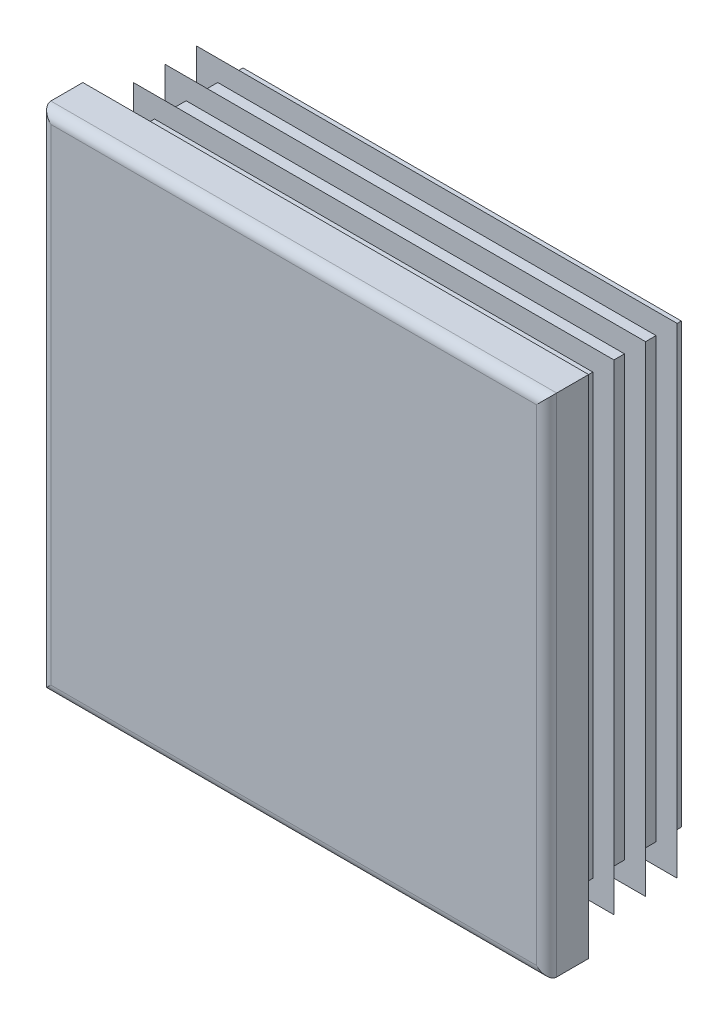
ISO-10303-21;
HEADER;
FILE_DESCRIPTION(('STEP AP214'),'2;1');
FILE_NAME('part.step','',(''),(''),'','','');
FILE_SCHEMA(('AUTOMOTIVE_DESIGN { 1 0 10303 214 1 1 1 1 }'));
ENDSEC;
DATA;
#1=APPLICATION_CONTEXT('core data for automotive mechanical design processes');
#2=APPLICATION_PROTOCOL_DEFINITION('international standard','automotive_design',2000,#1);
#3=PRODUCT_CONTEXT('',#1,'mechanical');
#4=PRODUCT('Part','Part','',(#3));
#5=PRODUCT_RELATED_PRODUCT_CATEGORY('part','',(#4));
#6=PRODUCT_DEFINITION_FORMATION('','',#4);
#7=PRODUCT_DEFINITION_CONTEXT('part definition',#1,'design');
#8=PRODUCT_DEFINITION('design','',#6,#7);
#9=PRODUCT_DEFINITION_SHAPE('','',#8);
#10=(LENGTH_UNIT() NAMED_UNIT(*) SI_UNIT(.MILLI.,.METRE.));
#11=(NAMED_UNIT(*) PLANE_ANGLE_UNIT() SI_UNIT($,.RADIAN.));
#12=(NAMED_UNIT(*) SI_UNIT($,.STERADIAN.) SOLID_ANGLE_UNIT());
#13=UNCERTAINTY_MEASURE_WITH_UNIT(LENGTH_MEASURE(1.E-05),#10,'distance_accuracy_value','');
#14=(GEOMETRIC_REPRESENTATION_CONTEXT(3) GLOBAL_UNCERTAINTY_ASSIGNED_CONTEXT((#13)) GLOBAL_UNIT_ASSIGNED_CONTEXT((#10,
#11,#12)) REPRESENTATION_CONTEXT('',''));
#15=CARTESIAN_POINT('',(0.,0.,0.));
#16=DIRECTION('',(0.,0.,1.));
#17=DIRECTION('',(1.,0.,0.));
#18=AXIS2_PLACEMENT_3D('',#15,#16,#17);
#19=CARTESIAN_POINT('',(28.8,-30.,5.));
#20=DIRECTION('',(0.,0.,-1.));
#21=DIRECTION('',(0.,1.,0.));
#22=AXIS2_PLACEMENT_3D('',#19,#20,#21);
#23=PLANE('',#22);
#24=DIRECTION('',(0.,1.,0.));
#25=VECTOR('',#24,1.);
#26=CARTESIAN_POINT('',(-28.8,-30.,5.));
#27=LINE('',#26,#25);
#28=CARTESIAN_POINT('',(-28.8,-28.8,5.));
#29=VERTEX_POINT('',#28);
#30=CARTESIAN_POINT('',(-28.8,28.8,5.));
#31=VERTEX_POINT('',#30);
#32=EDGE_CURVE('E262',#29,#31,#27,.T.);
#33=ORIENTED_EDGE('',*,*,#32,.F.);
#34=DIRECTION('',(-1.,0.,0.));
#35=VECTOR('',#34,1.);
#36=CARTESIAN_POINT('',(30.,-28.8,5.));
#37=LINE('',#36,#35);
#38=CARTESIAN_POINT('',(28.8,-28.8,5.));
#39=VERTEX_POINT('',#38);
#40=EDGE_CURVE('E432',#39,#29,#37,.T.);
#41=ORIENTED_EDGE('',*,*,#40,.F.);
#42=DIRECTION('',(0.,1.,0.));
#43=VECTOR('',#42,1.);
#44=CARTESIAN_POINT('',(28.8,-30.,5.));
#45=LINE('',#44,#43);
#46=CARTESIAN_POINT('',(28.8,28.8,5.));
#47=VERTEX_POINT('',#46);
#48=EDGE_CURVE('E257',#39,#47,#45,.T.);
#49=ORIENTED_EDGE('',*,*,#48,.T.);
#50=DIRECTION('',(-1.,0.,0.));
#51=VECTOR('',#50,1.);
#52=CARTESIAN_POINT('',(30.,28.8,5.));
#53=LINE('',#52,#51);
#54=EDGE_CURVE('E534',#47,#31,#53,.T.);
#55=ORIENTED_EDGE('',*,*,#54,.T.);
#56=EDGE_LOOP('',(#33,#41,#49,#55));
#57=FACE_BOUND('',#56,.T.);
#58=ADVANCED_FACE('F14',(#57),#23,.F.);
#59=CARTESIAN_POINT('',(-28.8,-30.,3.8));
#60=DIRECTION('',(0.,1.,0.));
#61=DIRECTION('',(-1.,0.,0.));
#62=AXIS2_PLACEMENT_3D('',#59,#60,#61);
#63=CYLINDRICAL_SURFACE('',#62,1.2);
#64=DIRECTION('',(0.,1.,0.));
#65=VECTOR('',#64,1.);
#66=CARTESIAN_POINT('',(-30.,-30.,3.8));
#67=LINE('',#66,#65);
#68=CARTESIAN_POINT('',(-30.,-30.,3.8));
#69=VERTEX_POINT('',#68);
#70=CARTESIAN_POINT('',(-30.,30.,3.8));
#71=VERTEX_POINT('',#70);
#72=EDGE_CURVE('E354',#69,#71,#67,.T.);
#73=ORIENTED_EDGE('',*,*,#72,.F.);
#74=CARTESIAN_POINT('',(-28.8,-28.8,3.8));
#75=DIRECTION('',(-0.707106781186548,0.707106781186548,0.));
#76=DIRECTION('',(0.707106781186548,0.707106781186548,0.));
#77=AXIS2_PLACEMENT_3D('',#74,#75,#76);
#78=ELLIPSE('',#77,1.69705627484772,1.2);
#79=EDGE_CURVE('E59',#69,#29,#78,.T.);
#80=ORIENTED_EDGE('',*,*,#79,.T.);
#81=ORIENTED_EDGE('',*,*,#32,.T.);
#82=CARTESIAN_POINT('',(-28.8,28.8,3.8));
#83=DIRECTION('',(0.707106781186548,0.707106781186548,0.));
#84=DIRECTION('',(-0.707106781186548,0.707106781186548,0.));
#85=AXIS2_PLACEMENT_3D('',#82,#83,#84);
#86=ELLIPSE('',#85,1.69705627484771,1.2);
#87=EDGE_CURVE('E258',#31,#71,#86,.F.);
#88=ORIENTED_EDGE('',*,*,#87,.T.);
#89=EDGE_LOOP('',(#73,#80,#81,#88));
#90=FACE_BOUND('',#89,.T.);
#91=ADVANCED_FACE('F16',(#90),#63,.T.);
#92=CARTESIAN_POINT('',(-30.,-30.,3.8));
#93=DIRECTION('',(1.,0.,0.));
#94=DIRECTION('',(0.,1.,0.));
#95=AXIS2_PLACEMENT_3D('',#92,#93,#94);
#96=PLANE('',#95);
#97=DIRECTION('',(0.,0.,-1.));
#98=VECTOR('',#97,1.);
#99=CARTESIAN_POINT('',(-30.,30.,3.8));
#100=LINE('',#99,#98);
#101=CARTESIAN_POINT('',(-30.,30.,0.));
#102=VERTEX_POINT('',#101);
#103=EDGE_CURVE('E519',#71,#102,#100,.T.);
#104=ORIENTED_EDGE('',*,*,#103,.T.);
#105=DIRECTION('',(0.,1.,0.));
#106=VECTOR('',#105,1.);
#107=CARTESIAN_POINT('',(-30.,-30.,0.));
#108=LINE('',#107,#106);
#109=CARTESIAN_POINT('',(-30.,-30.,0.));
#110=VERTEX_POINT('',#109);
#111=EDGE_CURVE('E352',#110,#102,#108,.T.);
#112=ORIENTED_EDGE('',*,*,#111,.F.);
#113=DIRECTION('',(0.,0.,-1.));
#114=VECTOR('',#113,1.);
#115=CARTESIAN_POINT('',(-30.,-30.,3.8));
#116=LINE('',#115,#114);
#117=EDGE_CURVE('E520',#69,#110,#116,.T.);
#118=ORIENTED_EDGE('',*,*,#117,.F.);
#119=ORIENTED_EDGE('',*,*,#72,.T.);
#120=EDGE_LOOP('',(#104,#112,#118,#119));
#121=FACE_BOUND('',#120,.T.);
#122=ADVANCED_FACE('F604',(#121),#96,.F.);
#123=CARTESIAN_POINT('',(-26.,-30.,0.));
#124=DIRECTION('',(1.,0.,0.));
#125=DIRECTION('',(0.,1.,0.));
#126=AXIS2_PLACEMENT_3D('',#123,#124,#125);
#127=PLANE('',#126);
#128=DIRECTION('',(0.,1.,0.));
#129=VECTOR('',#128,1.);
#130=CARTESIAN_POINT('',(-26.,-30.,0.));
#131=LINE('',#130,#129);
#132=CARTESIAN_POINT('',(-26.,-26.,0.));
#133=VERTEX_POINT('',#132);
#134=CARTESIAN_POINT('',(-26.,26.,0.));
#135=VERTEX_POINT('',#134);
#136=EDGE_CURVE('E349',#133,#135,#131,.T.);
#137=ORIENTED_EDGE('',*,*,#136,.T.);
#138=DIRECTION('',(0.,0.,-1.));
#139=VECTOR('',#138,1.);
#140=CARTESIAN_POINT('',(-26.,26.,0.));
#141=LINE('',#140,#139);
#142=CARTESIAN_POINT('',(-26.,26.,-0.75));
#143=VERTEX_POINT('',#142);
#144=EDGE_CURVE('E445',#135,#143,#141,.T.);
#145=ORIENTED_EDGE('',*,*,#144,.T.);
#146=DIRECTION('',(0.,1.,0.));
#147=VECTOR('',#146,1.);
#148=CARTESIAN_POINT('',(-26.,-30.,-0.75));
#149=LINE('',#148,#147);
#150=CARTESIAN_POINT('',(-26.,-26.,-0.75));
#151=VERTEX_POINT('',#150);
#152=EDGE_CURVE('E346',#151,#143,#149,.T.);
#153=ORIENTED_EDGE('',*,*,#152,.F.);
#154=DIRECTION('',(0.,0.,1.));
#155=VECTOR('',#154,1.);
#156=CARTESIAN_POINT('',(-26.,-26.,0.));
#157=LINE('',#156,#155);
#158=EDGE_CURVE('E439',#151,#133,#157,.T.);
#159=ORIENTED_EDGE('',*,*,#158,.T.);
#160=EDGE_LOOP('',(#137,#145,#153,#159));
#161=FACE_BOUND('',#160,.T.);
#162=ADVANCED_FACE('F728',(#161),#127,.F.);
#163=CARTESIAN_POINT('',(-28.5,-30.,-0.75));
#164=DIRECTION('',(0.573576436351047,0.,0.819152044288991));
#165=DIRECTION('',(-0.819152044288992,0.,0.573576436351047));
#166=AXIS2_PLACEMENT_3D('',#163,#164,#165);
#167=PLANE('',#166);
#168=DIRECTION('',(0.,1.,0.));
#169=VECTOR('',#168,1.);
#170=CARTESIAN_POINT('',(-28.5,-30.,-0.75));
#171=LINE('',#170,#169);
#172=CARTESIAN_POINT('',(-28.5,-28.5,-0.75));
#173=VERTEX_POINT('',#172);
#174=CARTESIAN_POINT('',(-28.5,28.5,-0.75));
#175=VERTEX_POINT('',#174);
#176=EDGE_CURVE('E344',#173,#175,#171,.T.);
#177=ORIENTED_EDGE('',*,*,#176,.T.);
#178=DIRECTION('',(0.633687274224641,-0.633687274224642,-0.443712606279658));
#179=VECTOR('',#178,1.);
#180=CARTESIAN_POINT('',(-5.008765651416,5.00876565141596,-17.1987393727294));
#181=LINE('',#180,#179);
#182=CARTESIAN_POINT('',(-26.,26.,-2.50051884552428));
#183=VERTEX_POINT('',#182);
#184=EDGE_CURVE('E457',#175,#183,#181,.T.);
#185=ORIENTED_EDGE('',*,*,#184,.T.);
#186=DIRECTION('',(0.,1.,0.));
#187=VECTOR('',#186,1.);
#188=CARTESIAN_POINT('',(-26.,-30.,-2.50051884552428));
#189=LINE('',#188,#187);
#190=CARTESIAN_POINT('',(-26.,-26.,-2.50051884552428));
#191=VERTEX_POINT('',#190);
#192=EDGE_CURVE('E341',#191,#183,#189,.T.);
#193=ORIENTED_EDGE('',*,*,#192,.F.);
#194=DIRECTION('',(-0.633687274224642,-0.633687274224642,0.443712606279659));
#195=VECTOR('',#194,1.);
#196=CARTESIAN_POINT('',(-29.1023393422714,-29.1023393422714,-0.328237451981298));
#197=LINE('',#196,#195);
#198=EDGE_CURVE('E451',#191,#173,#197,.T.);
#199=ORIENTED_EDGE('',*,*,#198,.T.);
#200=EDGE_LOOP('',(#177,#185,#193,#199));
#201=FACE_BOUND('',#200,.T.);
#202=ADVANCED_FACE('F732',(#201),#167,.F.);
#203=CARTESIAN_POINT('',(-26.,-30.,-2.50051884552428));
#204=DIRECTION('',(1.,0.,0.));
#205=DIRECTION('',(0.,1.,0.));
#206=AXIS2_PLACEMENT_3D('',#203,#204,#205);
#207=PLANE('',#206);
#208=ORIENTED_EDGE('',*,*,#192,.T.);
#209=DIRECTION('',(0.,0.,-1.));
#210=VECTOR('',#209,1.);
#211=CARTESIAN_POINT('',(-26.,26.,-2.50051884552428));
#212=LINE('',#211,#210);
#213=CARTESIAN_POINT('',(-26.,26.,-4.5));
#214=VERTEX_POINT('',#213);
#215=EDGE_CURVE('E463',#183,#214,#212,.T.);
#216=ORIENTED_EDGE('',*,*,#215,.T.);
#217=DIRECTION('',(0.,1.,0.));
#218=VECTOR('',#217,1.);
#219=CARTESIAN_POINT('',(-26.,-30.,-4.5));
#220=LINE('',#219,#218);
#221=CARTESIAN_POINT('',(-26.,-26.,-4.5));
#222=VERTEX_POINT('',#221);
#223=EDGE_CURVE('E338',#222,#214,#220,.T.);
#224=ORIENTED_EDGE('',*,*,#223,.F.);
#225=DIRECTION('',(0.,0.,1.));
#226=VECTOR('',#225,1.);
#227=CARTESIAN_POINT('',(-26.,-26.,-2.50051884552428));
#228=LINE('',#227,#226);
#229=EDGE_CURVE('E460',#222,#191,#228,.T.);
#230=ORIENTED_EDGE('',*,*,#229,.T.);
#231=EDGE_LOOP('',(#208,#216,#224,#230));
#232=FACE_BOUND('',#231,.T.);
#233=ADVANCED_FACE('F738',(#232),#207,.F.);
#234=CARTESIAN_POINT('',(-28.5,-30.,-4.5));
#235=DIRECTION('',(0.573576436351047,0.,0.819152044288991));
#236=DIRECTION('',(-0.819152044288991,0.,0.573576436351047));
#237=AXIS2_PLACEMENT_3D('',#234,#235,#236);
#238=PLANE('',#237);
#239=DIRECTION('',(0.,1.,0.));
#240=VECTOR('',#239,1.);
#241=CARTESIAN_POINT('',(-28.5,-30.,-4.5));
#242=LINE('',#241,#240);
#243=CARTESIAN_POINT('',(-28.5,-28.5,-4.5));
#244=VERTEX_POINT('',#243);
#245=CARTESIAN_POINT('',(-28.5,28.5,-4.5));
#246=VERTEX_POINT('',#245);
#247=EDGE_CURVE('E336',#244,#246,#242,.T.);
#248=ORIENTED_EDGE('',*,*,#247,.T.);
#249=DIRECTION('',(0.633687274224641,-0.633687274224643,-0.443712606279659));
#250=VECTOR('',#249,1.);
#251=CARTESIAN_POINT('',(-5.008765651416,5.00876565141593,-20.9487393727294));
#252=LINE('',#251,#250);
#253=CARTESIAN_POINT('',(-26.,26.,-6.25051884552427));
#254=VERTEX_POINT('',#253);
#255=EDGE_CURVE('E475',#246,#254,#252,.T.);
#256=ORIENTED_EDGE('',*,*,#255,.T.);
#257=DIRECTION('',(0.,1.,0.));
#258=VECTOR('',#257,1.);
#259=CARTESIAN_POINT('',(-26.,-30.,-6.25051884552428));
#260=LINE('',#259,#258);
#261=CARTESIAN_POINT('',(-26.,-26.,-6.25051884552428));
#262=VERTEX_POINT('',#261);
#263=EDGE_CURVE('E333',#262,#254,#260,.T.);
#264=ORIENTED_EDGE('',*,*,#263,.F.);
#265=DIRECTION('',(-0.633687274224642,-0.633687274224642,0.443712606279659));
#266=VECTOR('',#265,1.);
#267=CARTESIAN_POINT('',(-29.1023393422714,-29.1023393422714,-4.0782374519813));
#268=LINE('',#267,#266);
#269=EDGE_CURVE('E469',#262,#244,#268,.T.);
#270=ORIENTED_EDGE('',*,*,#269,.T.);
#271=EDGE_LOOP('',(#248,#256,#264,#270));
#272=FACE_BOUND('',#271,.T.);
#273=ADVANCED_FACE('F742',(#272),#238,.F.);
#274=CARTESIAN_POINT('',(-26.,-30.,-6.25051884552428));
#275=DIRECTION('',(1.,0.,0.));
#276=DIRECTION('',(0.,1.,0.));
#277=AXIS2_PLACEMENT_3D('',#274,#275,#276);
#278=PLANE('',#277);
#279=ORIENTED_EDGE('',*,*,#263,.T.);
#280=DIRECTION('',(0.,0.,-1.));
#281=VECTOR('',#280,1.);
#282=CARTESIAN_POINT('',(-26.,26.,-6.25051884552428));
#283=LINE('',#282,#281);
#284=CARTESIAN_POINT('',(-26.,26.,-8.25));
#285=VERTEX_POINT('',#284);
#286=EDGE_CURVE('E481',#254,#285,#283,.T.);
#287=ORIENTED_EDGE('',*,*,#286,.T.);
#288=DIRECTION('',(0.,1.,0.));
#289=VECTOR('',#288,1.);
#290=CARTESIAN_POINT('',(-26.,-30.,-8.25));
#291=LINE('',#290,#289);
#292=CARTESIAN_POINT('',(-26.,-26.,-8.25));
#293=VERTEX_POINT('',#292);
#294=EDGE_CURVE('E330',#293,#285,#291,.T.);
#295=ORIENTED_EDGE('',*,*,#294,.F.);
#296=DIRECTION('',(0.,0.,1.));
#297=VECTOR('',#296,1.);
#298=CARTESIAN_POINT('',(-26.,-26.,-6.25051884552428));
#299=LINE('',#298,#297);
#300=EDGE_CURVE('E478',#293,#262,#299,.T.);
#301=ORIENTED_EDGE('',*,*,#300,.T.);
#302=EDGE_LOOP('',(#279,#287,#295,#301));
#303=FACE_BOUND('',#302,.T.);
#304=ADVANCED_FACE('F746',(#303),#278,.F.);
#305=CARTESIAN_POINT('',(-28.5,-30.,-8.25));
#306=DIRECTION('',(0.573576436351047,0.,0.819152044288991));
#307=DIRECTION('',(-0.819152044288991,0.,0.573576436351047));
#308=AXIS2_PLACEMENT_3D('',#305,#306,#307);
#309=PLANE('',#308);
#310=DIRECTION('',(0.,1.,0.));
#311=VECTOR('',#310,1.);
#312=CARTESIAN_POINT('',(-28.5,-30.,-8.25));
#313=LINE('',#312,#311);
#314=CARTESIAN_POINT('',(-28.5,-28.5,-8.25));
#315=VERTEX_POINT('',#314);
#316=CARTESIAN_POINT('',(-28.5,28.5,-8.25));
#317=VERTEX_POINT('',#316);
#318=EDGE_CURVE('E328',#315,#317,#313,.T.);
#319=ORIENTED_EDGE('',*,*,#318,.T.);
#320=DIRECTION('',(0.633687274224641,-0.633687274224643,-0.443712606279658));
#321=VECTOR('',#320,1.);
#322=CARTESIAN_POINT('',(-5.00876565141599,5.00876565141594,-24.6987393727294));
#323=LINE('',#322,#321);
#324=CARTESIAN_POINT('',(-26.,26.,-10.0005188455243));
#325=VERTEX_POINT('',#324);
#326=EDGE_CURVE('E493',#317,#325,#323,.T.);
#327=ORIENTED_EDGE('',*,*,#326,.T.);
#328=DIRECTION('',(0.,1.,0.));
#329=VECTOR('',#328,1.);
#330=CARTESIAN_POINT('',(-26.,-30.,-10.0005188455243));
#331=LINE('',#330,#329);
#332=CARTESIAN_POINT('',(-26.,-26.,-10.0005188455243));
#333=VERTEX_POINT('',#332);
#334=EDGE_CURVE('E325',#333,#325,#331,.T.);
#335=ORIENTED_EDGE('',*,*,#334,.F.);
#336=DIRECTION('',(-0.633687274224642,-0.633687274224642,0.443712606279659));
#337=VECTOR('',#336,1.);
#338=CARTESIAN_POINT('',(-29.1023393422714,-29.1023393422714,-7.8282374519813));
#339=LINE('',#338,#337);
#340=EDGE_CURVE('E487',#333,#315,#339,.T.);
#341=ORIENTED_EDGE('',*,*,#340,.T.);
#342=EDGE_LOOP('',(#319,#327,#335,#341));
#343=FACE_BOUND('',#342,.T.);
#344=ADVANCED_FACE('F668',(#343),#309,.F.);
#345=CARTESIAN_POINT('',(-26.,-30.,-10.0005188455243));
#346=DIRECTION('',(1.,0.,0.));
#347=DIRECTION('',(0.,1.,0.));
#348=AXIS2_PLACEMENT_3D('',#345,#346,#347);
#349=PLANE('',#348);
#350=ORIENTED_EDGE('',*,*,#334,.T.);
#351=DIRECTION('',(0.,0.,-1.));
#352=VECTOR('',#351,1.);
#353=CARTESIAN_POINT('',(-26.,26.,-10.0005188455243));
#354=LINE('',#353,#352);
#355=CARTESIAN_POINT('',(-26.,26.,-12.));
#356=VERTEX_POINT('',#355);
#357=EDGE_CURVE('E499',#325,#356,#354,.T.);
#358=ORIENTED_EDGE('',*,*,#357,.T.);
#359=DIRECTION('',(0.,1.,0.));
#360=VECTOR('',#359,1.);
#361=CARTESIAN_POINT('',(-26.,-30.,-12.));
#362=LINE('',#361,#360);
#363=CARTESIAN_POINT('',(-26.,-26.,-12.));
#364=VERTEX_POINT('',#363);
#365=EDGE_CURVE('E322',#364,#356,#362,.T.);
#366=ORIENTED_EDGE('',*,*,#365,.F.);
#367=DIRECTION('',(0.,0.,1.));
#368=VECTOR('',#367,1.);
#369=CARTESIAN_POINT('',(-26.,-26.,-10.0005188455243));
#370=LINE('',#369,#368);
#371=EDGE_CURVE('E496',#364,#333,#370,.T.);
#372=ORIENTED_EDGE('',*,*,#371,.T.);
#373=EDGE_LOOP('',(#350,#358,#366,#372));
#374=FACE_BOUND('',#373,.T.);
#375=ADVANCED_FACE('F665',(#374),#349,.F.);
#376=CARTESIAN_POINT('',(-28.5,-30.,-12.));
#377=DIRECTION('',(0.573576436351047,0.,0.819152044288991));
#378=DIRECTION('',(-0.819152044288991,0.,0.573576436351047));
#379=AXIS2_PLACEMENT_3D('',#376,#377,#378);
#380=PLANE('',#379);
#381=DIRECTION('',(0.,1.,0.));
#382=VECTOR('',#381,1.);
#383=CARTESIAN_POINT('',(-28.5,-30.,-12.));
#384=LINE('',#383,#382);
#385=CARTESIAN_POINT('',(-28.5,-28.5,-12.));
#386=VERTEX_POINT('',#385);
#387=CARTESIAN_POINT('',(-28.5,28.5,-12.));
#388=VERTEX_POINT('',#387);
#389=EDGE_CURVE('E320',#386,#388,#384,.T.);
#390=ORIENTED_EDGE('',*,*,#389,.T.);
#391=DIRECTION('',(0.633687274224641,-0.633687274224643,-0.443712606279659));
#392=VECTOR('',#391,1.);
#393=CARTESIAN_POINT('',(-5.008765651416,5.00876565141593,-28.4487393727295));
#394=LINE('',#393,#392);
#395=CARTESIAN_POINT('',(-26.,26.,-13.7505188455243));
#396=VERTEX_POINT('',#395);
#397=EDGE_CURVE('E511',#388,#396,#394,.T.);
#398=ORIENTED_EDGE('',*,*,#397,.T.);
#399=DIRECTION('',(0.,1.,0.));
#400=VECTOR('',#399,1.);
#401=CARTESIAN_POINT('',(-26.,-30.,-13.7505188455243));
#402=LINE('',#401,#400);
#403=CARTESIAN_POINT('',(-26.,-26.,-13.7505188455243));
#404=VERTEX_POINT('',#403);
#405=EDGE_CURVE('E317',#404,#396,#402,.T.);
#406=ORIENTED_EDGE('',*,*,#405,.F.);
#407=DIRECTION('',(-0.633687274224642,-0.633687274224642,0.443712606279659));
#408=VECTOR('',#407,1.);
#409=CARTESIAN_POINT('',(-29.1023393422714,-29.1023393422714,-11.5782374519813));
#410=LINE('',#409,#408);
#411=EDGE_CURVE('E505',#404,#386,#410,.T.);
#412=ORIENTED_EDGE('',*,*,#411,.T.);
#413=EDGE_LOOP('',(#390,#398,#406,#412));
#414=FACE_BOUND('',#413,.T.);
#415=ADVANCED_FACE('F580',(#414),#380,.F.);
#416=CARTESIAN_POINT('',(-26.,-30.,-13.7505188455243));
#417=DIRECTION('',(1.,0.,0.));
#418=DIRECTION('',(0.,1.,0.));
#419=AXIS2_PLACEMENT_3D('',#416,#417,#418);
#420=PLANE('',#419);
#421=ORIENTED_EDGE('',*,*,#405,.T.);
#422=DIRECTION('',(0.,0.,-1.));
#423=VECTOR('',#422,1.);
#424=CARTESIAN_POINT('',(-26.,26.,-13.7505188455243));
#425=LINE('',#424,#423);
#426=CARTESIAN_POINT('',(-26.,26.,-15.));
#427=VERTEX_POINT('',#426);
#428=EDGE_CURVE('E517',#396,#427,#425,.T.);
#429=ORIENTED_EDGE('',*,*,#428,.T.);
#430=DIRECTION('',(0.,1.,0.));
#431=VECTOR('',#430,1.);
#432=CARTESIAN_POINT('',(-26.,-30.,-15.));
#433=LINE('',#432,#431);
#434=CARTESIAN_POINT('',(-26.,-26.,-15.));
#435=VERTEX_POINT('',#434);
#436=EDGE_CURVE('E314',#435,#427,#433,.T.);
#437=ORIENTED_EDGE('',*,*,#436,.F.);
#438=DIRECTION('',(0.,0.,1.));
#439=VECTOR('',#438,1.);
#440=CARTESIAN_POINT('',(-26.,-26.,-13.7505188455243));
#441=LINE('',#440,#439);
#442=EDGE_CURVE('E514',#435,#404,#441,.T.);
#443=ORIENTED_EDGE('',*,*,#442,.T.);
#444=EDGE_LOOP('',(#421,#429,#437,#443));
#445=FACE_BOUND('',#444,.T.);
#446=ADVANCED_FACE('F582',(#445),#420,.F.);
#447=CARTESIAN_POINT('',(-26.,-30.,-15.));
#448=DIRECTION('',(0.,0.,1.));
#449=DIRECTION('',(0.,-1.,0.));
#450=AXIS2_PLACEMENT_3D('',#447,#448,#449);
#451=PLANE('',#450);
#452=ORIENTED_EDGE('',*,*,#436,.T.);
#453=DIRECTION('',(-1.,0.,0.));
#454=VECTOR('',#453,1.);
#455=CARTESIAN_POINT('',(30.,26.,-15.));
#456=LINE('',#455,#454);
#457=CARTESIAN_POINT('',(26.,26.,-15.));
#458=VERTEX_POINT('',#457);
#459=EDGE_CURVE('E388',#458,#427,#456,.T.);
#460=ORIENTED_EDGE('',*,*,#459,.F.);
#461=DIRECTION('',(0.,1.,0.));
#462=VECTOR('',#461,1.);
#463=CARTESIAN_POINT('',(26.,-30.,-15.));
#464=LINE('',#463,#462);
#465=CARTESIAN_POINT('',(26.,-26.,-15.));
#466=VERTEX_POINT('',#465);
#467=EDGE_CURVE('E311',#466,#458,#464,.T.);
#468=ORIENTED_EDGE('',*,*,#467,.F.);
#469=DIRECTION('',(-1.,0.,0.));
#470=VECTOR('',#469,1.);
#471=CARTESIAN_POINT('',(30.,-26.,-15.));
#472=LINE('',#471,#470);
#473=EDGE_CURVE('E386',#466,#435,#472,.T.);
#474=ORIENTED_EDGE('',*,*,#473,.T.);
#475=EDGE_LOOP('',(#452,#460,#468,#474));
#476=FACE_BOUND('',#475,.T.);
#477=ADVANCED_FACE('F385',(#476),#451,.F.);
#478=CARTESIAN_POINT('',(26.,-30.,-15.));
#479=DIRECTION('',(-1.,0.,0.));
#480=DIRECTION('',(0.,-1.,0.));
#481=AXIS2_PLACEMENT_3D('',#478,#479,#480);
#482=PLANE('',#481);
#483=ORIENTED_EDGE('',*,*,#467,.T.);
#484=DIRECTION('',(0.,0.,1.));
#485=VECTOR('',#484,1.);
#486=CARTESIAN_POINT('',(26.,26.,-15.));
#487=LINE('',#486,#485);
#488=CARTESIAN_POINT('',(26.,26.,-13.7505188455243));
#489=VERTEX_POINT('',#488);
#490=EDGE_CURVE('E9',#458,#489,#487,.T.);
#491=ORIENTED_EDGE('',*,*,#490,.T.);
#492=DIRECTION('',(0.,1.,0.));
#493=VECTOR('',#492,1.);
#494=CARTESIAN_POINT('',(26.,-30.,-13.7505188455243));
#495=LINE('',#494,#493);
#496=CARTESIAN_POINT('',(26.,-26.,-13.7505188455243));
#497=VERTEX_POINT('',#496);
#498=EDGE_CURVE('E308',#497,#489,#495,.T.);
#499=ORIENTED_EDGE('',*,*,#498,.F.);
#500=DIRECTION('',(0.,0.,-1.));
#501=VECTOR('',#500,1.);
#502=CARTESIAN_POINT('',(26.,-26.,-15.));
#503=LINE('',#502,#501);
#504=EDGE_CURVE('E23',#497,#466,#503,.T.);
#505=ORIENTED_EDGE('',*,*,#504,.T.);
#506=EDGE_LOOP('',(#483,#491,#499,#505));
#507=FACE_BOUND('',#506,.T.);
#508=ADVANCED_FACE('F378',(#507),#482,.F.);
#509=CARTESIAN_POINT('',(26.,-30.,-13.7505188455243));
#510=DIRECTION('',(-0.573576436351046,0.,0.819152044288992));
#511=DIRECTION('',(-0.819152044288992,0.,-0.573576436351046));
#512=AXIS2_PLACEMENT_3D('',#509,#510,#511);
#513=PLANE('',#512);
#514=ORIENTED_EDGE('',*,*,#498,.T.);
#515=DIRECTION('',(0.633687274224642,0.633687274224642,0.443712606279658));
#516=VECTOR('',#515,1.);
#517=CARTESIAN_POINT('',(3.51266455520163,3.51266455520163,-29.4963206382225));
#518=LINE('',#517,#516);
#519=CARTESIAN_POINT('',(28.5,28.5,-12.));
#520=VERTEX_POINT('',#519);
#521=EDGE_CURVE('E508',#489,#520,#518,.T.);
#522=ORIENTED_EDGE('',*,*,#521,.T.);
#523=DIRECTION('',(0.,1.,0.));
#524=VECTOR('',#523,1.);
#525=CARTESIAN_POINT('',(28.5,-30.,-12.));
#526=LINE('',#525,#524);
#527=CARTESIAN_POINT('',(28.5,-28.5,-12.));
#528=VERTEX_POINT('',#527);
#529=EDGE_CURVE('E305',#528,#520,#526,.T.);
#530=ORIENTED_EDGE('',*,*,#529,.F.);
#531=DIRECTION('',(-0.633687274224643,0.633687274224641,-0.443712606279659));
#532=VECTOR('',#531,1.);
#533=CARTESIAN_POINT('',(27.606238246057,-27.606238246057,-12.6258187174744));
#534=LINE('',#533,#532);
#535=EDGE_CURVE('E502',#528,#497,#534,.T.);
#536=ORIENTED_EDGE('',*,*,#535,.T.);
#537=EDGE_LOOP('',(#514,#522,#530,#536));
#538=FACE_BOUND('',#537,.T.);
#539=ADVANCED_FACE('F588',(#538),#513,.F.);
#540=CARTESIAN_POINT('',(28.5,-30.,-12.));
#541=DIRECTION('',(0.,0.,-1.));
#542=DIRECTION('',(0.,1.,0.));
#543=AXIS2_PLACEMENT_3D('',#540,#541,#542);
#544=PLANE('',#543);
#545=ORIENTED_EDGE('',*,*,#529,.T.);
#546=DIRECTION('',(-1.,0.,0.));
#547=VECTOR('',#546,1.);
#548=CARTESIAN_POINT('',(30.,28.5,-12.));
#549=LINE('',#548,#547);
#550=EDGE_CURVE('E394',#520,#388,#549,.T.);
#551=ORIENTED_EDGE('',*,*,#550,.T.);
#552=ORIENTED_EDGE('',*,*,#389,.F.);
#553=DIRECTION('',(-1.,0.,0.));
#554=VECTOR('',#553,1.);
#555=CARTESIAN_POINT('',(30.,-28.5,-12.));
#556=LINE('',#555,#554);
#557=EDGE_CURVE('E401',#528,#386,#556,.T.);
#558=ORIENTED_EDGE('',*,*,#557,.F.);
#559=EDGE_LOOP('',(#545,#551,#552,#558));
#560=FACE_BOUND('',#559,.T.);
#561=ORIENTED_EDGE('',*,*,#365,.T.);
#562=DIRECTION('',(-1.,0.,0.));
#563=VECTOR('',#562,1.);
#564=CARTESIAN_POINT('',(30.,26.,-12.));
#565=LINE('',#564,#563);
#566=CARTESIAN_POINT('',(26.,26.,-12.));
#567=VERTEX_POINT('',#566);
#568=EDGE_CURVE('E567',#567,#356,#565,.T.);
#569=ORIENTED_EDGE('',*,*,#568,.F.);
#570=DIRECTION('',(0.,1.,0.));
#571=VECTOR('',#570,1.);
#572=CARTESIAN_POINT('',(26.,-30.,-12.));
#573=LINE('',#572,#571);
#574=CARTESIAN_POINT('',(26.,-26.,-12.));
#575=VERTEX_POINT('',#574);
#576=EDGE_CURVE('E302',#575,#567,#573,.T.);
#577=ORIENTED_EDGE('',*,*,#576,.F.);
#578=DIRECTION('',(-1.,0.,0.));
#579=VECTOR('',#578,1.);
#580=CARTESIAN_POINT('',(30.,-26.,-12.));
#581=LINE('',#580,#579);
#582=EDGE_CURVE('E403',#575,#364,#581,.T.);
#583=ORIENTED_EDGE('',*,*,#582,.T.);
#584=EDGE_LOOP('',(#561,#569,#577,#583));
#585=FACE_BOUND('',#584,.T.);
#586=ADVANCED_FACE('F571',(#560,#585),#544,.F.);
#587=CARTESIAN_POINT('',(26.,-30.,-12.));
#588=DIRECTION('',(-1.,0.,0.));
#589=DIRECTION('',(0.,-1.,0.));
#590=AXIS2_PLACEMENT_3D('',#587,#588,#589);
#591=PLANE('',#590);
#592=ORIENTED_EDGE('',*,*,#576,.T.);
#593=DIRECTION('',(0.,0.,1.));
#594=VECTOR('',#593,1.);
#595=CARTESIAN_POINT('',(26.,26.,-12.));
#596=LINE('',#595,#594);
#597=CARTESIAN_POINT('',(26.,26.,-10.0005188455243));
#598=VERTEX_POINT('',#597);
#599=EDGE_CURVE('E372',#567,#598,#596,.T.);
#600=ORIENTED_EDGE('',*,*,#599,.T.);
#601=DIRECTION('',(0.,1.,0.));
#602=VECTOR('',#601,1.);
#603=CARTESIAN_POINT('',(26.,-30.,-10.0005188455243));
#604=LINE('',#603,#602);
#605=CARTESIAN_POINT('',(26.,-26.,-10.0005188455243));
#606=VERTEX_POINT('',#605);
#607=EDGE_CURVE('E299',#606,#598,#604,.T.);
#608=ORIENTED_EDGE('',*,*,#607,.F.);
#609=DIRECTION('',(0.,0.,-1.));
#610=VECTOR('',#609,1.);
#611=CARTESIAN_POINT('',(26.,-26.,-12.));
#612=LINE('',#611,#610);
#613=EDGE_CURVE('E369',#606,#575,#612,.T.);
#614=ORIENTED_EDGE('',*,*,#613,.T.);
#615=EDGE_LOOP('',(#592,#600,#608,#614));
#616=FACE_BOUND('',#615,.T.);
#617=ADVANCED_FACE('F596',(#616),#591,.F.);
#618=CARTESIAN_POINT('',(26.,-30.,-10.0005188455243));
#619=DIRECTION('',(-0.573576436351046,0.,0.819152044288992));
#620=DIRECTION('',(-0.819152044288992,0.,-0.573576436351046));
#621=AXIS2_PLACEMENT_3D('',#618,#619,#620);
#622=PLANE('',#621);
#623=ORIENTED_EDGE('',*,*,#607,.T.);
#624=DIRECTION('',(0.633687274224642,0.633687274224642,0.443712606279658));
#625=VECTOR('',#624,1.);
#626=CARTESIAN_POINT('',(3.51266455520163,3.51266455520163,-25.7463206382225));
#627=LINE('',#626,#625);
#628=CARTESIAN_POINT('',(28.5,28.5,-8.25));
#629=VERTEX_POINT('',#628);
#630=EDGE_CURVE('E490',#598,#629,#627,.T.);
#631=ORIENTED_EDGE('',*,*,#630,.T.);
#632=DIRECTION('',(0.,1.,0.));
#633=VECTOR('',#632,1.);
#634=CARTESIAN_POINT('',(28.5,-30.,-8.25));
#635=LINE('',#634,#633);
#636=CARTESIAN_POINT('',(28.5,-28.5,-8.25));
#637=VERTEX_POINT('',#636);
#638=EDGE_CURVE('E296',#637,#629,#635,.T.);
#639=ORIENTED_EDGE('',*,*,#638,.F.);
#640=DIRECTION('',(-0.633687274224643,0.633687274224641,-0.443712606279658));
#641=VECTOR('',#640,1.);
#642=CARTESIAN_POINT('',(27.606238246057,-27.606238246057,-8.8758187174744));
#643=LINE('',#642,#641);
#644=EDGE_CURVE('E484',#637,#606,#643,.T.);
#645=ORIENTED_EDGE('',*,*,#644,.T.);
#646=EDGE_LOOP('',(#623,#631,#639,#645));
#647=FACE_BOUND('',#646,.T.);
#648=ADVANCED_FACE('F648',(#647),#622,.F.);
#649=CARTESIAN_POINT('',(28.5,-30.,-8.25));
#650=DIRECTION('',(0.,0.,-1.));
#651=DIRECTION('',(0.,1.,0.));
#652=AXIS2_PLACEMENT_3D('',#649,#650,#651);
#653=PLANE('',#652);
#654=ORIENTED_EDGE('',*,*,#638,.T.);
#655=DIRECTION('',(-1.,0.,0.));
#656=VECTOR('',#655,1.);
#657=CARTESIAN_POINT('',(30.,28.5,-8.25));
#658=LINE('',#657,#656);
#659=EDGE_CURVE('E561',#629,#317,#658,.T.);
#660=ORIENTED_EDGE('',*,*,#659,.T.);
#661=ORIENTED_EDGE('',*,*,#318,.F.);
#662=DIRECTION('',(-1.,0.,0.));
#663=VECTOR('',#662,1.);
#664=CARTESIAN_POINT('',(30.,-28.5,-8.25));
#665=LINE('',#664,#663);
#666=EDGE_CURVE('E409',#637,#315,#665,.T.);
#667=ORIENTED_EDGE('',*,*,#666,.F.);
#668=EDGE_LOOP('',(#654,#660,#661,#667));
#669=FACE_BOUND('',#668,.T.);
#670=ORIENTED_EDGE('',*,*,#294,.T.);
#671=DIRECTION('',(-1.,0.,0.));
#672=VECTOR('',#671,1.);
#673=CARTESIAN_POINT('',(30.,26.,-8.25));
#674=LINE('',#673,#672);
#675=CARTESIAN_POINT('',(26.,26.,-8.25));
#676=VERTEX_POINT('',#675);
#677=EDGE_CURVE('E559',#676,#285,#674,.T.);
#678=ORIENTED_EDGE('',*,*,#677,.F.);
#679=DIRECTION('',(0.,1.,0.));
#680=VECTOR('',#679,1.);
#681=CARTESIAN_POINT('',(26.,-30.,-8.25));
#682=LINE('',#681,#680);
#683=CARTESIAN_POINT('',(26.,-26.,-8.25));
#684=VERTEX_POINT('',#683);
#685=EDGE_CURVE('E293',#684,#676,#682,.T.);
#686=ORIENTED_EDGE('',*,*,#685,.F.);
#687=DIRECTION('',(-1.,0.,0.));
#688=VECTOR('',#687,1.);
#689=CARTESIAN_POINT('',(30.,-26.,-8.25));
#690=LINE('',#689,#688);
#691=EDGE_CURVE('E411',#684,#293,#690,.T.);
#692=ORIENTED_EDGE('',*,*,#691,.T.);
#693=EDGE_LOOP('',(#670,#678,#686,#692));
#694=FACE_BOUND('',#693,.T.);
#695=ADVANCED_FACE('F644',(#669,#694),#653,.F.);
#696=CARTESIAN_POINT('',(26.,-30.,-8.25));
#697=DIRECTION('',(-1.,0.,0.));
#698=DIRECTION('',(0.,-1.,0.));
#699=AXIS2_PLACEMENT_3D('',#696,#697,#698);
#700=PLANE('',#699);
#701=ORIENTED_EDGE('',*,*,#685,.T.);
#702=DIRECTION('',(0.,0.,1.));
#703=VECTOR('',#702,1.);
#704=CARTESIAN_POINT('',(26.,26.,-8.25));
#705=LINE('',#704,#703);
#706=CARTESIAN_POINT('',(26.,26.,-6.25051884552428));
#707=VERTEX_POINT('',#706);
#708=EDGE_CURVE('E366',#676,#707,#705,.T.);
#709=ORIENTED_EDGE('',*,*,#708,.T.);
#710=DIRECTION('',(0.,1.,0.));
#711=VECTOR('',#710,1.);
#712=CARTESIAN_POINT('',(26.,-30.,-6.25051884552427));
#713=LINE('',#712,#711);
#714=CARTESIAN_POINT('',(26.,-26.,-6.25051884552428));
#715=VERTEX_POINT('',#714);
#716=EDGE_CURVE('E290',#715,#707,#713,.T.);
#717=ORIENTED_EDGE('',*,*,#716,.F.);
#718=DIRECTION('',(0.,0.,-1.));
#719=VECTOR('',#718,1.);
#720=CARTESIAN_POINT('',(26.,-26.,-8.25));
#721=LINE('',#720,#719);
#722=EDGE_CURVE('E363',#715,#684,#721,.T.);
#723=ORIENTED_EDGE('',*,*,#722,.T.);
#724=EDGE_LOOP('',(#701,#709,#717,#723));
#725=FACE_BOUND('',#724,.T.);
#726=ADVANCED_FACE('F640',(#725),#700,.F.);
#727=CARTESIAN_POINT('',(26.,-30.,-6.25051884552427));
#728=DIRECTION('',(-0.573576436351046,0.,0.819152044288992));
#729=DIRECTION('',(-0.819152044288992,0.,-0.573576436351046));
#730=AXIS2_PLACEMENT_3D('',#727,#728,#729);
#731=PLANE('',#730);
#732=ORIENTED_EDGE('',*,*,#716,.T.);
#733=DIRECTION('',(0.633687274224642,0.633687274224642,0.443712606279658));
#734=VECTOR('',#733,1.);
#735=CARTESIAN_POINT('',(3.51266455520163,3.51266455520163,-21.9963206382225));
#736=LINE('',#735,#734);
#737=CARTESIAN_POINT('',(28.5,28.5,-4.5));
#738=VERTEX_POINT('',#737);
#739=EDGE_CURVE('E472',#707,#738,#736,.T.);
#740=ORIENTED_EDGE('',*,*,#739,.T.);
#741=DIRECTION('',(0.,1.,0.));
#742=VECTOR('',#741,1.);
#743=CARTESIAN_POINT('',(28.5,-30.,-4.5));
#744=LINE('',#743,#742);
#745=CARTESIAN_POINT('',(28.5,-28.5,-4.5));
#746=VERTEX_POINT('',#745);
#747=EDGE_CURVE('E287',#746,#738,#744,.T.);
#748=ORIENTED_EDGE('',*,*,#747,.F.);
#749=DIRECTION('',(-0.633687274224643,0.633687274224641,-0.443712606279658));
#750=VECTOR('',#749,1.);
#751=CARTESIAN_POINT('',(27.606238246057,-27.606238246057,-5.1258187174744));
#752=LINE('',#751,#750);
#753=EDGE_CURVE('E466',#746,#715,#752,.T.);
#754=ORIENTED_EDGE('',*,*,#753,.T.);
#755=EDGE_LOOP('',(#732,#740,#748,#754));
#756=FACE_BOUND('',#755,.T.);
#757=ADVANCED_FACE('F636',(#756),#731,.F.);
#758=CARTESIAN_POINT('',(28.5,-30.,-4.5));
#759=DIRECTION('',(0.,0.,-1.));
#760=DIRECTION('',(0.,1.,0.));
#761=AXIS2_PLACEMENT_3D('',#758,#759,#760);
#762=PLANE('',#761);
#763=ORIENTED_EDGE('',*,*,#747,.T.);
#764=DIRECTION('',(-1.,0.,0.));
#765=VECTOR('',#764,1.);
#766=CARTESIAN_POINT('',(30.,28.5,-4.5));
#767=LINE('',#766,#765);
#768=EDGE_CURVE('E553',#738,#246,#767,.T.);
#769=ORIENTED_EDGE('',*,*,#768,.T.);
#770=ORIENTED_EDGE('',*,*,#247,.F.);
#771=DIRECTION('',(-1.,0.,0.));
#772=VECTOR('',#771,1.);
#773=CARTESIAN_POINT('',(30.,-28.5,-4.5));
#774=LINE('',#773,#772);
#775=EDGE_CURVE('E417',#746,#244,#774,.T.);
#776=ORIENTED_EDGE('',*,*,#775,.F.);
#777=EDGE_LOOP('',(#763,#769,#770,#776));
#778=FACE_BOUND('',#777,.T.);
#779=ORIENTED_EDGE('',*,*,#223,.T.);
#780=DIRECTION('',(-1.,0.,0.));
#781=VECTOR('',#780,1.);
#782=CARTESIAN_POINT('',(30.,26.,-4.5));
#783=LINE('',#782,#781);
#784=CARTESIAN_POINT('',(26.,26.,-4.5));
#785=VERTEX_POINT('',#784);
#786=EDGE_CURVE('E551',#785,#214,#783,.T.);
#787=ORIENTED_EDGE('',*,*,#786,.F.);
#788=DIRECTION('',(0.,1.,0.));
#789=VECTOR('',#788,1.);
#790=CARTESIAN_POINT('',(26.,-30.,-4.5));
#791=LINE('',#790,#789);
#792=CARTESIAN_POINT('',(26.,-26.,-4.5));
#793=VERTEX_POINT('',#792);
#794=EDGE_CURVE('E284',#793,#785,#791,.T.);
#795=ORIENTED_EDGE('',*,*,#794,.F.);
#796=DIRECTION('',(-1.,0.,0.));
#797=VECTOR('',#796,1.);
#798=CARTESIAN_POINT('',(30.,-26.,-4.5));
#799=LINE('',#798,#797);
#800=EDGE_CURVE('E419',#793,#222,#799,.T.);
#801=ORIENTED_EDGE('',*,*,#800,.T.);
#802=EDGE_LOOP('',(#779,#787,#795,#801));
#803=FACE_BOUND('',#802,.T.);
#804=ADVANCED_FACE('F632',(#778,#803),#762,.F.);
#805=CARTESIAN_POINT('',(26.,-30.,-4.5));
#806=DIRECTION('',(-1.,0.,0.));
#807=DIRECTION('',(0.,-1.,0.));
#808=AXIS2_PLACEMENT_3D('',#805,#806,#807);
#809=PLANE('',#808);
#810=ORIENTED_EDGE('',*,*,#794,.T.);
#811=DIRECTION('',(0.,0.,1.));
#812=VECTOR('',#811,1.);
#813=CARTESIAN_POINT('',(26.,26.,-4.5));
#814=LINE('',#813,#812);
#815=CARTESIAN_POINT('',(26.,26.,-2.50051884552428));
#816=VERTEX_POINT('',#815);
#817=EDGE_CURVE('E360',#785,#816,#814,.T.);
#818=ORIENTED_EDGE('',*,*,#817,.T.);
#819=DIRECTION('',(0.,1.,0.));
#820=VECTOR('',#819,1.);
#821=CARTESIAN_POINT('',(26.,-30.,-2.50051884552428));
#822=LINE('',#821,#820);
#823=CARTESIAN_POINT('',(26.,-26.,-2.50051884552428));
#824=VERTEX_POINT('',#823);
#825=EDGE_CURVE('E281',#824,#816,#822,.T.);
#826=ORIENTED_EDGE('',*,*,#825,.F.);
#827=DIRECTION('',(0.,0.,-1.));
#828=VECTOR('',#827,1.);
#829=CARTESIAN_POINT('',(26.,-26.,-4.5));
#830=LINE('',#829,#828);
#831=EDGE_CURVE('E357',#824,#793,#830,.T.);
#832=ORIENTED_EDGE('',*,*,#831,.T.);
#833=EDGE_LOOP('',(#810,#818,#826,#832));
#834=FACE_BOUND('',#833,.T.);
#835=ADVANCED_FACE('F628',(#834),#809,.F.);
#836=CARTESIAN_POINT('',(26.,-30.,-2.50051884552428));
#837=DIRECTION('',(-0.573576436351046,0.,0.819152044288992));
#838=DIRECTION('',(-0.819152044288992,0.,-0.573576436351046));
#839=AXIS2_PLACEMENT_3D('',#836,#837,#838);
#840=PLANE('',#839);
#841=ORIENTED_EDGE('',*,*,#825,.T.);
#842=DIRECTION('',(0.633687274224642,0.633687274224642,0.443712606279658));
#843=VECTOR('',#842,1.);
#844=CARTESIAN_POINT('',(3.51266455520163,3.51266455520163,-18.2463206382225));
#845=LINE('',#844,#843);
#846=CARTESIAN_POINT('',(28.5,28.5,-0.75));
#847=VERTEX_POINT('',#846);
#848=EDGE_CURVE('E454',#816,#847,#845,.T.);
#849=ORIENTED_EDGE('',*,*,#848,.T.);
#850=DIRECTION('',(0.,1.,0.));
#851=VECTOR('',#850,1.);
#852=CARTESIAN_POINT('',(28.5,-30.,-0.75));
#853=LINE('',#852,#851);
#854=CARTESIAN_POINT('',(28.5,-28.5,-0.75));
#855=VERTEX_POINT('',#854);
#856=EDGE_CURVE('E278',#855,#847,#853,.T.);
#857=ORIENTED_EDGE('',*,*,#856,.F.);
#858=DIRECTION('',(-0.633687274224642,0.633687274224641,-0.443712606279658));
#859=VECTOR('',#858,1.);
#860=CARTESIAN_POINT('',(27.606238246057,-27.606238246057,-1.3758187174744));
#861=LINE('',#860,#859);
#862=EDGE_CURVE('E448',#855,#824,#861,.T.);
#863=ORIENTED_EDGE('',*,*,#862,.T.);
#864=EDGE_LOOP('',(#841,#849,#857,#863));
#865=FACE_BOUND('',#864,.T.);
#866=ADVANCED_FACE('F624',(#865),#840,.F.);
#867=CARTESIAN_POINT('',(28.5,-30.,-0.75));
#868=DIRECTION('',(0.,0.,-1.));
#869=DIRECTION('',(0.,1.,0.));
#870=AXIS2_PLACEMENT_3D('',#867,#868,#869);
#871=PLANE('',#870);
#872=ORIENTED_EDGE('',*,*,#856,.T.);
#873=DIRECTION('',(-1.,0.,0.));
#874=VECTOR('',#873,1.);
#875=CARTESIAN_POINT('',(30.,28.5,-0.75));
#876=LINE('',#875,#874);
#877=EDGE_CURVE('E545',#847,#175,#876,.T.);
#878=ORIENTED_EDGE('',*,*,#877,.T.);
#879=ORIENTED_EDGE('',*,*,#176,.F.);
#880=DIRECTION('',(-1.,0.,0.));
#881=VECTOR('',#880,1.);
#882=CARTESIAN_POINT('',(30.,-28.5,-0.75));
#883=LINE('',#882,#881);
#884=EDGE_CURVE('E425',#855,#173,#883,.T.);
#885=ORIENTED_EDGE('',*,*,#884,.F.);
#886=EDGE_LOOP('',(#872,#878,#879,#885));
#887=FACE_BOUND('',#886,.T.);
#888=ORIENTED_EDGE('',*,*,#152,.T.);
#889=DIRECTION('',(-1.,0.,0.));
#890=VECTOR('',#889,1.);
#891=CARTESIAN_POINT('',(30.,26.,-0.75));
#892=LINE('',#891,#890);
#893=CARTESIAN_POINT('',(26.,26.,-0.75));
#894=VERTEX_POINT('',#893);
#895=EDGE_CURVE('E543',#894,#143,#892,.T.);
#896=ORIENTED_EDGE('',*,*,#895,.F.);
#897=DIRECTION('',(0.,1.,0.));
#898=VECTOR('',#897,1.);
#899=CARTESIAN_POINT('',(26.,-30.,-0.75));
#900=LINE('',#899,#898);
#901=CARTESIAN_POINT('',(26.,-26.,-0.75));
#902=VERTEX_POINT('',#901);
#903=EDGE_CURVE('E275',#902,#894,#900,.T.);
#904=ORIENTED_EDGE('',*,*,#903,.F.);
#905=DIRECTION('',(-1.,0.,0.));
#906=VECTOR('',#905,1.);
#907=CARTESIAN_POINT('',(30.,-26.,-0.75));
#908=LINE('',#907,#906);
#909=EDGE_CURVE('E427',#902,#151,#908,.T.);
#910=ORIENTED_EDGE('',*,*,#909,.T.);
#911=EDGE_LOOP('',(#888,#896,#904,#910));
#912=FACE_BOUND('',#911,.T.);
#913=ADVANCED_FACE('F620',(#887,#912),#871,.F.);
#914=CARTESIAN_POINT('',(26.,-30.,-0.75));
#915=DIRECTION('',(-1.,0.,0.));
#916=DIRECTION('',(0.,-1.,0.));
#917=AXIS2_PLACEMENT_3D('',#914,#915,#916);
#918=PLANE('',#917);
#919=ORIENTED_EDGE('',*,*,#903,.T.);
#920=DIRECTION('',(0.,0.,1.));
#921=VECTOR('',#920,1.);
#922=CARTESIAN_POINT('',(26.,26.,-0.75));
#923=LINE('',#922,#921);
#924=CARTESIAN_POINT('',(26.,26.,0.));
#925=VERTEX_POINT('',#924);
#926=EDGE_CURVE('E442',#894,#925,#923,.T.);
#927=ORIENTED_EDGE('',*,*,#926,.T.);
#928=DIRECTION('',(0.,1.,0.));
#929=VECTOR('',#928,1.);
#930=CARTESIAN_POINT('',(26.,-30.,0.));
#931=LINE('',#930,#929);
#932=CARTESIAN_POINT('',(26.,-26.,0.));
#933=VERTEX_POINT('',#932);
#934=EDGE_CURVE('E268',#933,#925,#931,.T.);
#935=ORIENTED_EDGE('',*,*,#934,.F.);
#936=DIRECTION('',(0.,0.,-1.));
#937=VECTOR('',#936,1.);
#938=CARTESIAN_POINT('',(26.,-26.,-0.75));
#939=LINE('',#938,#937);
#940=EDGE_CURVE('E436',#933,#902,#939,.T.);
#941=ORIENTED_EDGE('',*,*,#940,.T.);
#942=EDGE_LOOP('',(#919,#927,#935,#941));
#943=FACE_BOUND('',#942,.T.);
#944=ADVANCED_FACE('F616',(#943),#918,.F.);
#945=CARTESIAN_POINT('',(26.,-30.,0.));
#946=DIRECTION('',(0.,0.,1.));
#947=DIRECTION('',(0.,-1.,0.));
#948=AXIS2_PLACEMENT_3D('',#945,#946,#947);
#949=PLANE('',#948);
#950=DIRECTION('',(-1.,0.,0.));
#951=VECTOR('',#950,1.);
#952=CARTESIAN_POINT('',(30.,26.,0.));
#953=LINE('',#952,#951);
#954=EDGE_CURVE('E538',#925,#135,#953,.T.);
#955=ORIENTED_EDGE('',*,*,#954,.T.);
#956=ORIENTED_EDGE('',*,*,#136,.F.);
#957=DIRECTION('',(-1.,0.,0.));
#958=VECTOR('',#957,1.);
#959=CARTESIAN_POINT('',(30.,-26.,0.));
#960=LINE('',#959,#958);
#961=EDGE_CURVE('E248',#933,#133,#960,.T.);
#962=ORIENTED_EDGE('',*,*,#961,.F.);
#963=ORIENTED_EDGE('',*,*,#934,.T.);
#964=EDGE_LOOP('',(#955,#956,#962,#963));
#965=FACE_BOUND('',#964,.T.);
#966=ORIENTED_EDGE('',*,*,#111,.T.);
#967=DIRECTION('',(1.,0.,0.));
#968=VECTOR('',#967,1.);
#969=CARTESIAN_POINT('',(26.,30.,0.));
#970=LINE('',#969,#968);
#971=CARTESIAN_POINT('',(30.,30.,0.));
#972=VERTEX_POINT('',#971);
#973=EDGE_CURVE('E525',#102,#972,#970,.T.);
#974=ORIENTED_EDGE('',*,*,#973,.T.);
#975=DIRECTION('',(0.,1.,0.));
#976=VECTOR('',#975,1.);
#977=CARTESIAN_POINT('',(30.,-30.,0.));
#978=LINE('',#977,#976);
#979=CARTESIAN_POINT('',(30.,-30.,0.));
#980=VERTEX_POINT('',#979);
#981=EDGE_CURVE('E45',#980,#972,#978,.T.);
#982=ORIENTED_EDGE('',*,*,#981,.F.);
#983=DIRECTION('',(1.,0.,0.));
#984=VECTOR('',#983,1.);
#985=CARTESIAN_POINT('',(-30.,-30.,0.));
#986=LINE('',#985,#984);
#987=EDGE_CURVE('E31',#110,#980,#986,.T.);
#988=ORIENTED_EDGE('',*,*,#987,.F.);
#989=EDGE_LOOP('',(#966,#974,#982,#988));
#990=FACE_BOUND('',#989,.T.);
#991=ADVANCED_FACE('F613',(#965,#990),#949,.F.);
#992=CARTESIAN_POINT('',(30.,-30.,0.));
#993=DIRECTION('',(-1.,0.,0.));
#994=DIRECTION('',(0.,-1.,0.));
#995=AXIS2_PLACEMENT_3D('',#992,#993,#994);
#996=PLANE('',#995);
#997=DIRECTION('',(0.,0.,1.));
#998=VECTOR('',#997,1.);
#999=CARTESIAN_POINT('',(30.,30.,0.));
#1000=LINE('',#999,#998);
#1001=CARTESIAN_POINT('',(30.,30.,3.8));
#1002=VERTEX_POINT('',#1001);
#1003=EDGE_CURVE('E266',#972,#1002,#1000,.T.);
#1004=ORIENTED_EDGE('',*,*,#1003,.T.);
#1005=DIRECTION('',(0.,1.,0.));
#1006=VECTOR('',#1005,1.);
#1007=CARTESIAN_POINT('',(30.,-30.,3.8));
#1008=LINE('',#1007,#1006);
#1009=CARTESIAN_POINT('',(30.,-30.,3.8));
#1010=VERTEX_POINT('',#1009);
#1011=EDGE_CURVE('E255',#1010,#1002,#1008,.T.);
#1012=ORIENTED_EDGE('',*,*,#1011,.F.);
#1013=DIRECTION('',(0.,0.,1.));
#1014=VECTOR('',#1013,1.);
#1015=CARTESIAN_POINT('',(30.,-30.,0.));
#1016=LINE('',#1015,#1014);
#1017=EDGE_CURVE('E260',#980,#1010,#1016,.T.);
#1018=ORIENTED_EDGE('',*,*,#1017,.F.);
#1019=ORIENTED_EDGE('',*,*,#981,.T.);
#1020=EDGE_LOOP('',(#1004,#1012,#1018,#1019));
#1021=FACE_BOUND('',#1020,.T.);
#1022=ADVANCED_FACE('F264',(#1021),#996,.F.);
#1023=CARTESIAN_POINT('',(28.8,-30.,3.8));
#1024=DIRECTION('',(0.,1.,0.));
#1025=DIRECTION('',(-1.,0.,0.));
#1026=AXIS2_PLACEMENT_3D('',#1023,#1024,#1025);
#1027=CYLINDRICAL_SURFACE('',#1026,1.2);
#1028=ORIENTED_EDGE('',*,*,#48,.F.);
#1029=CARTESIAN_POINT('',(28.8,-28.8,3.8));
#1030=DIRECTION('',(0.707106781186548,0.707106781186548,0.));
#1031=DIRECTION('',(-0.707106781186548,0.707106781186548,0.));
#1032=AXIS2_PLACEMENT_3D('',#1029,#1030,#1031);
#1033=ELLIPSE('',#1032,1.69705627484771,1.2);
#1034=EDGE_CURVE('E245',#39,#1010,#1033,.T.);
#1035=ORIENTED_EDGE('',*,*,#1034,.T.);
#1036=ORIENTED_EDGE('',*,*,#1011,.T.);
#1037=CARTESIAN_POINT('',(28.8,28.8,3.8));
#1038=DIRECTION('',(-0.707106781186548,0.707106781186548,0.));
#1039=DIRECTION('',(0.707106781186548,0.707106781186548,0.));
#1040=AXIS2_PLACEMENT_3D('',#1037,#1038,#1039);
#1041=ELLIPSE('',#1040,1.6970562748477,1.2);
#1042=EDGE_CURVE('E52',#1002,#47,#1041,.F.);
#1043=ORIENTED_EDGE('',*,*,#1042,.T.);
#1044=EDGE_LOOP('',(#1028,#1035,#1036,#1043));
#1045=FACE_BOUND('',#1044,.T.);
#1046=ADVANCED_FACE('F253',(#1045),#1027,.T.);
#1047=CARTESIAN_POINT('',(-28.8,-30.,3.8));
#1048=DIRECTION('',(0.,-1.,0.));
#1049=DIRECTION('',(1.,0.,0.));
#1050=AXIS2_PLACEMENT_3D('',#1047,#1048,#1049);
#1051=PLANE('',#1050);
#1052=DIRECTION('',(-1.,0.,0.));
#1053=VECTOR('',#1052,1.);
#1054=CARTESIAN_POINT('',(30.,-30.,3.8));
#1055=LINE('',#1054,#1053);
#1056=EDGE_CURVE('E242',#1010,#69,#1055,.T.);
#1057=ORIENTED_EDGE('',*,*,#1056,.T.);
#1058=ORIENTED_EDGE('',*,*,#117,.T.);
#1059=ORIENTED_EDGE('',*,*,#987,.T.);
#1060=ORIENTED_EDGE('',*,*,#1017,.T.);
#1061=EDGE_LOOP('',(#1057,#1058,#1059,#1060));
#1062=FACE_BOUND('',#1061,.T.);
#1063=ADVANCED_FACE('F261',(#1062),#1051,.T.);
#1064=CARTESIAN_POINT('',(-28.8,30.,3.8));
#1065=DIRECTION('',(0.,-1.,0.));
#1066=DIRECTION('',(1.,0.,0.));
#1067=AXIS2_PLACEMENT_3D('',#1064,#1065,#1066);
#1068=PLANE('',#1067);
#1069=ORIENTED_EDGE('',*,*,#103,.F.);
#1070=DIRECTION('',(-1.,0.,0.));
#1071=VECTOR('',#1070,1.);
#1072=CARTESIAN_POINT('',(30.,30.,3.8));
#1073=LINE('',#1072,#1071);
#1074=EDGE_CURVE('E535',#1002,#71,#1073,.T.);
#1075=ORIENTED_EDGE('',*,*,#1074,.F.);
#1076=ORIENTED_EDGE('',*,*,#1003,.F.);
#1077=ORIENTED_EDGE('',*,*,#973,.F.);
#1078=EDGE_LOOP('',(#1069,#1075,#1076,#1077));
#1079=FACE_BOUND('',#1078,.T.);
#1080=ADVANCED_FACE('F607',(#1079),#1068,.F.);
#1081=CARTESIAN_POINT('',(30.,26.,-0.75));
#1082=DIRECTION('',(0.,-1.,0.));
#1083=DIRECTION('',(1.,0.,0.));
#1084=AXIS2_PLACEMENT_3D('',#1081,#1082,#1083);
#1085=PLANE('',#1084);
#1086=ORIENTED_EDGE('',*,*,#954,.F.);
#1087=ORIENTED_EDGE('',*,*,#926,.F.);
#1088=ORIENTED_EDGE('',*,*,#895,.T.);
#1089=ORIENTED_EDGE('',*,*,#144,.F.);
#1090=EDGE_LOOP('',(#1086,#1087,#1088,#1089));
#1091=FACE_BOUND('',#1090,.T.);
#1092=ADVANCED_FACE('F715',(#1091),#1085,.F.);
#1093=CARTESIAN_POINT('',(30.,26.,-2.50051884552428));
#1094=DIRECTION('',(0.,-0.573576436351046,0.819152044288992));
#1095=DIRECTION('',(0.,-0.819152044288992,-0.573576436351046));
#1096=AXIS2_PLACEMENT_3D('',#1093,#1094,#1095);
#1097=PLANE('',#1096);
#1098=ORIENTED_EDGE('',*,*,#877,.F.);
#1099=ORIENTED_EDGE('',*,*,#848,.F.);
#1100=DIRECTION('',(-1.,0.,0.));
#1101=VECTOR('',#1100,1.);
#1102=CARTESIAN_POINT('',(30.,26.,-2.50051884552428));
#1103=LINE('',#1102,#1101);
#1104=EDGE_CURVE('E548',#816,#183,#1103,.T.);
#1105=ORIENTED_EDGE('',*,*,#1104,.T.);
#1106=ORIENTED_EDGE('',*,*,#184,.F.);
#1107=EDGE_LOOP('',(#1098,#1099,#1105,#1106));
#1108=FACE_BOUND('',#1107,.T.);
#1109=ADVANCED_FACE('F720',(#1108),#1097,.F.);
#1110=CARTESIAN_POINT('',(30.,26.,-4.5));
#1111=DIRECTION('',(0.,-1.,0.));
#1112=DIRECTION('',(1.,0.,0.));
#1113=AXIS2_PLACEMENT_3D('',#1110,#1111,#1112);
#1114=PLANE('',#1113);
#1115=ORIENTED_EDGE('',*,*,#1104,.F.);
#1116=ORIENTED_EDGE('',*,*,#817,.F.);
#1117=ORIENTED_EDGE('',*,*,#786,.T.);
#1118=ORIENTED_EDGE('',*,*,#215,.F.);
#1119=EDGE_LOOP('',(#1115,#1116,#1117,#1118));
#1120=FACE_BOUND('',#1119,.T.);
#1121=ADVANCED_FACE('F882',(#1120),#1114,.F.);
#1122=CARTESIAN_POINT('',(30.,26.,-6.25051884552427));
#1123=DIRECTION('',(0.,-0.573576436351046,0.819152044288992));
#1124=DIRECTION('',(0.,-0.819152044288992,-0.573576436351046));
#1125=AXIS2_PLACEMENT_3D('',#1122,#1123,#1124);
#1126=PLANE('',#1125);
#1127=ORIENTED_EDGE('',*,*,#768,.F.);
#1128=ORIENTED_EDGE('',*,*,#739,.F.);
#1129=DIRECTION('',(-1.,0.,0.));
#1130=VECTOR('',#1129,1.);
#1131=CARTESIAN_POINT('',(30.,26.,-6.25051884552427));
#1132=LINE('',#1131,#1130);
#1133=EDGE_CURVE('E556',#707,#254,#1132,.T.);
#1134=ORIENTED_EDGE('',*,*,#1133,.T.);
#1135=ORIENTED_EDGE('',*,*,#255,.F.);
#1136=EDGE_LOOP('',(#1127,#1128,#1134,#1135));
#1137=FACE_BOUND('',#1136,.T.);
#1138=ADVANCED_FACE('F892',(#1137),#1126,.F.);
#1139=CARTESIAN_POINT('',(30.,26.,-8.25));
#1140=DIRECTION('',(0.,-1.,0.));
#1141=DIRECTION('',(1.,0.,0.));
#1142=AXIS2_PLACEMENT_3D('',#1139,#1140,#1141);
#1143=PLANE('',#1142);
#1144=ORIENTED_EDGE('',*,*,#1133,.F.);
#1145=ORIENTED_EDGE('',*,*,#708,.F.);
#1146=ORIENTED_EDGE('',*,*,#677,.T.);
#1147=ORIENTED_EDGE('',*,*,#286,.F.);
#1148=EDGE_LOOP('',(#1144,#1145,#1146,#1147));
#1149=FACE_BOUND('',#1148,.T.);
#1150=ADVANCED_FACE('F902',(#1149),#1143,.F.);
#1151=CARTESIAN_POINT('',(30.,26.,-10.0005188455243));
#1152=DIRECTION('',(0.,-0.573576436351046,0.819152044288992));
#1153=DIRECTION('',(0.,-0.819152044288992,-0.573576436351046));
#1154=AXIS2_PLACEMENT_3D('',#1151,#1152,#1153);
#1155=PLANE('',#1154);
#1156=ORIENTED_EDGE('',*,*,#659,.F.);
#1157=ORIENTED_EDGE('',*,*,#630,.F.);
#1158=DIRECTION('',(-1.,0.,0.));
#1159=VECTOR('',#1158,1.);
#1160=CARTESIAN_POINT('',(30.,26.,-10.0005188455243));
#1161=LINE('',#1160,#1159);
#1162=EDGE_CURVE('E564',#598,#325,#1161,.T.);
#1163=ORIENTED_EDGE('',*,*,#1162,.T.);
#1164=ORIENTED_EDGE('',*,*,#326,.F.);
#1165=EDGE_LOOP('',(#1156,#1157,#1163,#1164));
#1166=FACE_BOUND('',#1165,.T.);
#1167=ADVANCED_FACE('F672',(#1166),#1155,.F.);
#1168=CARTESIAN_POINT('',(30.,26.,-12.));
#1169=DIRECTION('',(0.,-1.,0.));
#1170=DIRECTION('',(1.,0.,0.));
#1171=AXIS2_PLACEMENT_3D('',#1168,#1169,#1170);
#1172=PLANE('',#1171);
#1173=ORIENTED_EDGE('',*,*,#1162,.F.);
#1174=ORIENTED_EDGE('',*,*,#599,.F.);
#1175=ORIENTED_EDGE('',*,*,#568,.T.);
#1176=ORIENTED_EDGE('',*,*,#357,.F.);
#1177=EDGE_LOOP('',(#1173,#1174,#1175,#1176));
#1178=FACE_BOUND('',#1177,.T.);
#1179=ADVANCED_FACE('F663',(#1178),#1172,.F.);
#1180=CARTESIAN_POINT('',(30.,26.,-13.7505188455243));
#1181=DIRECTION('',(0.,-0.573576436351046,0.819152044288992));
#1182=DIRECTION('',(0.,-0.819152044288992,-0.573576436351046));
#1183=AXIS2_PLACEMENT_3D('',#1180,#1181,#1182);
#1184=PLANE('',#1183);
#1185=ORIENTED_EDGE('',*,*,#550,.F.);
#1186=ORIENTED_EDGE('',*,*,#521,.F.);
#1187=DIRECTION('',(-1.,0.,0.));
#1188=VECTOR('',#1187,1.);
#1189=CARTESIAN_POINT('',(30.,26.,-13.7505188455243));
#1190=LINE('',#1189,#1188);
#1191=EDGE_CURVE('E391',#489,#396,#1190,.T.);
#1192=ORIENTED_EDGE('',*,*,#1191,.T.);
#1193=ORIENTED_EDGE('',*,*,#397,.F.);
#1194=EDGE_LOOP('',(#1185,#1186,#1192,#1193));
#1195=FACE_BOUND('',#1194,.T.);
#1196=ADVANCED_FACE('F576',(#1195),#1184,.F.);
#1197=CARTESIAN_POINT('',(30.,26.,-15.));
#1198=DIRECTION('',(0.,-1.,0.));
#1199=DIRECTION('',(1.,0.,0.));
#1200=AXIS2_PLACEMENT_3D('',#1197,#1198,#1199);
#1201=PLANE('',#1200);
#1202=ORIENTED_EDGE('',*,*,#1191,.F.);
#1203=ORIENTED_EDGE('',*,*,#490,.F.);
#1204=ORIENTED_EDGE('',*,*,#459,.T.);
#1205=ORIENTED_EDGE('',*,*,#428,.F.);
#1206=EDGE_LOOP('',(#1202,#1203,#1204,#1205));
#1207=FACE_BOUND('',#1206,.T.);
#1208=ADVANCED_FACE('F937',(#1207),#1201,.F.);
#1209=CARTESIAN_POINT('',(30.,28.8,3.8));
#1210=DIRECTION('',(-1.,0.,0.));
#1211=DIRECTION('',(0.,-1.,0.));
#1212=AXIS2_PLACEMENT_3D('',#1209,#1210,#1211);
#1213=CYLINDRICAL_SURFACE('',#1212,1.2);
#1214=ORIENTED_EDGE('',*,*,#54,.F.);
#1215=ORIENTED_EDGE('',*,*,#1042,.F.);
#1216=ORIENTED_EDGE('',*,*,#1074,.T.);
#1217=ORIENTED_EDGE('',*,*,#87,.F.);
#1218=EDGE_LOOP('',(#1214,#1215,#1216,#1217));
#1219=FACE_BOUND('',#1218,.T.);
#1220=ADVANCED_FACE('F709',(#1219),#1213,.T.);
#1221=CARTESIAN_POINT('',(30.,-26.,0.));
#1222=DIRECTION('',(0.,1.,0.));
#1223=DIRECTION('',(-1.,0.,0.));
#1224=AXIS2_PLACEMENT_3D('',#1221,#1222,#1223);
#1225=PLANE('',#1224);
#1226=ORIENTED_EDGE('',*,*,#909,.F.);
#1227=ORIENTED_EDGE('',*,*,#940,.F.);
#1228=ORIENTED_EDGE('',*,*,#961,.T.);
#1229=ORIENTED_EDGE('',*,*,#158,.F.);
#1230=EDGE_LOOP('',(#1226,#1227,#1228,#1229));
#1231=FACE_BOUND('',#1230,.T.);
#1232=ADVANCED_FACE('F706',(#1231),#1225,.F.);
#1233=CARTESIAN_POINT('',(30.,-28.5,-0.75));
#1234=DIRECTION('',(0.,0.573576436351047,0.819152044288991));
#1235=DIRECTION('',(0.,-0.819152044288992,0.573576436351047));
#1236=AXIS2_PLACEMENT_3D('',#1233,#1234,#1235);
#1237=PLANE('',#1236);
#1238=DIRECTION('',(-1.,0.,0.));
#1239=VECTOR('',#1238,1.);
#1240=CARTESIAN_POINT('',(30.,-26.,-2.50051884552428));
#1241=LINE('',#1240,#1239);
#1242=EDGE_CURVE('E422',#824,#191,#1241,.T.);
#1243=ORIENTED_EDGE('',*,*,#1242,.F.);
#1244=ORIENTED_EDGE('',*,*,#862,.F.);
#1245=ORIENTED_EDGE('',*,*,#884,.T.);
#1246=ORIENTED_EDGE('',*,*,#198,.F.);
#1247=EDGE_LOOP('',(#1243,#1244,#1245,#1246));
#1248=FACE_BOUND('',#1247,.T.);
#1249=ADVANCED_FACE('F702',(#1248),#1237,.F.);
#1250=CARTESIAN_POINT('',(30.,-26.,-2.50051884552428));
#1251=DIRECTION('',(0.,1.,0.));
#1252=DIRECTION('',(-1.,0.,0.));
#1253=AXIS2_PLACEMENT_3D('',#1250,#1251,#1252);
#1254=PLANE('',#1253);
#1255=ORIENTED_EDGE('',*,*,#800,.F.);
#1256=ORIENTED_EDGE('',*,*,#831,.F.);
#1257=ORIENTED_EDGE('',*,*,#1242,.T.);
#1258=ORIENTED_EDGE('',*,*,#229,.F.);
#1259=EDGE_LOOP('',(#1255,#1256,#1257,#1258));
#1260=FACE_BOUND('',#1259,.T.);
#1261=ADVANCED_FACE('F698',(#1260),#1254,.F.);
#1262=CARTESIAN_POINT('',(30.,-28.5,-4.5));
#1263=DIRECTION('',(0.,0.573576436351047,0.819152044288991));
#1264=DIRECTION('',(0.,-0.819152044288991,0.573576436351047));
#1265=AXIS2_PLACEMENT_3D('',#1262,#1263,#1264);
#1266=PLANE('',#1265);
#1267=DIRECTION('',(-1.,0.,0.));
#1268=VECTOR('',#1267,1.);
#1269=CARTESIAN_POINT('',(30.,-26.,-6.25051884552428));
#1270=LINE('',#1269,#1268);
#1271=EDGE_CURVE('E414',#715,#262,#1270,.T.);
#1272=ORIENTED_EDGE('',*,*,#1271,.F.);
#1273=ORIENTED_EDGE('',*,*,#753,.F.);
#1274=ORIENTED_EDGE('',*,*,#775,.T.);
#1275=ORIENTED_EDGE('',*,*,#269,.F.);
#1276=EDGE_LOOP('',(#1272,#1273,#1274,#1275));
#1277=FACE_BOUND('',#1276,.T.);
#1278=ADVANCED_FACE('F694',(#1277),#1266,.F.);
#1279=CARTESIAN_POINT('',(30.,-26.,-6.25051884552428));
#1280=DIRECTION('',(0.,1.,0.));
#1281=DIRECTION('',(-1.,0.,0.));
#1282=AXIS2_PLACEMENT_3D('',#1279,#1280,#1281);
#1283=PLANE('',#1282);
#1284=ORIENTED_EDGE('',*,*,#691,.F.);
#1285=ORIENTED_EDGE('',*,*,#722,.F.);
#1286=ORIENTED_EDGE('',*,*,#1271,.T.);
#1287=ORIENTED_EDGE('',*,*,#300,.F.);
#1288=EDGE_LOOP('',(#1284,#1285,#1286,#1287));
#1289=FACE_BOUND('',#1288,.T.);
#1290=ADVANCED_FACE('F688',(#1289),#1283,.F.);
#1291=CARTESIAN_POINT('',(30.,-28.5,-8.25));
#1292=DIRECTION('',(0.,0.573576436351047,0.819152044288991));
#1293=DIRECTION('',(0.,-0.819152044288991,0.573576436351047));
#1294=AXIS2_PLACEMENT_3D('',#1291,#1292,#1293);
#1295=PLANE('',#1294);
#1296=DIRECTION('',(-1.,0.,0.));
#1297=VECTOR('',#1296,1.);
#1298=CARTESIAN_POINT('',(30.,-26.,-10.0005188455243));
#1299=LINE('',#1298,#1297);
#1300=EDGE_CURVE('E406',#606,#333,#1299,.T.);
#1301=ORIENTED_EDGE('',*,*,#1300,.F.);
#1302=ORIENTED_EDGE('',*,*,#644,.F.);
#1303=ORIENTED_EDGE('',*,*,#666,.T.);
#1304=ORIENTED_EDGE('',*,*,#340,.F.);
#1305=EDGE_LOOP('',(#1301,#1302,#1303,#1304));
#1306=FACE_BOUND('',#1305,.T.);
#1307=ADVANCED_FACE('F678',(#1306),#1295,.F.);
#1308=CARTESIAN_POINT('',(30.,-26.,-10.0005188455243));
#1309=DIRECTION('',(0.,1.,0.));
#1310=DIRECTION('',(-1.,0.,0.));
#1311=AXIS2_PLACEMENT_3D('',#1308,#1309,#1310);
#1312=PLANE('',#1311);
#1313=ORIENTED_EDGE('',*,*,#582,.F.);
#1314=ORIENTED_EDGE('',*,*,#613,.F.);
#1315=ORIENTED_EDGE('',*,*,#1300,.T.);
#1316=ORIENTED_EDGE('',*,*,#371,.F.);
#1317=EDGE_LOOP('',(#1313,#1314,#1315,#1316));
#1318=FACE_BOUND('',#1317,.T.);
#1319=ADVANCED_FACE('F680',(#1318),#1312,.F.);
#1320=CARTESIAN_POINT('',(30.,-28.5,-12.));
#1321=DIRECTION('',(0.,0.573576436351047,0.819152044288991));
#1322=DIRECTION('',(0.,-0.819152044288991,0.573576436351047));
#1323=AXIS2_PLACEMENT_3D('',#1320,#1321,#1322);
#1324=PLANE('',#1323);
#1325=DIRECTION('',(-1.,0.,0.));
#1326=VECTOR('',#1325,1.);
#1327=CARTESIAN_POINT('',(30.,-26.,-13.7505188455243));
#1328=LINE('',#1327,#1326);
#1329=EDGE_CURVE('E396',#497,#404,#1328,.T.);
#1330=ORIENTED_EDGE('',*,*,#1329,.F.);
#1331=ORIENTED_EDGE('',*,*,#535,.F.);
#1332=ORIENTED_EDGE('',*,*,#557,.T.);
#1333=ORIENTED_EDGE('',*,*,#411,.F.);
#1334=EDGE_LOOP('',(#1330,#1331,#1332,#1333));
#1335=FACE_BOUND('',#1334,.T.);
#1336=ADVANCED_FACE('F586',(#1335),#1324,.F.);
#1337=CARTESIAN_POINT('',(30.,-26.,-13.7505188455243));
#1338=DIRECTION('',(0.,1.,0.));
#1339=DIRECTION('',(-1.,0.,0.));
#1340=AXIS2_PLACEMENT_3D('',#1337,#1338,#1339);
#1341=PLANE('',#1340);
#1342=ORIENTED_EDGE('',*,*,#473,.F.);
#1343=ORIENTED_EDGE('',*,*,#504,.F.);
#1344=ORIENTED_EDGE('',*,*,#1329,.T.);
#1345=ORIENTED_EDGE('',*,*,#442,.F.);
#1346=EDGE_LOOP('',(#1342,#1343,#1344,#1345));
#1347=FACE_BOUND('',#1346,.T.);
#1348=ADVANCED_FACE('F583',(#1347),#1341,.F.);
#1349=CARTESIAN_POINT('',(30.,-28.8,3.8));
#1350=DIRECTION('',(-1.,0.,0.));
#1351=DIRECTION('',(0.,-1.,0.));
#1352=AXIS2_PLACEMENT_3D('',#1349,#1350,#1351);
#1353=CYLINDRICAL_SURFACE('',#1352,1.2);
#1354=ORIENTED_EDGE('',*,*,#1056,.F.);
#1355=ORIENTED_EDGE('',*,*,#1034,.F.);
#1356=ORIENTED_EDGE('',*,*,#40,.T.);
#1357=ORIENTED_EDGE('',*,*,#79,.F.);
#1358=EDGE_LOOP('',(#1354,#1355,#1356,#1357));
#1359=FACE_BOUND('',#1358,.T.);
#1360=ADVANCED_FACE('F244',(#1359),#1353,.T.);
#1361=CLOSED_SHELL('',(#58,#91,#122,#162,#202,#233,#273,#304,#344,#375,#415,#446,#477,#508,#539,
#586,#617,#648,#695,#726,#757,#804,#835,#866,#913,#944,#991,#1022,#1046,#1063,#1080,#1092,#1109,
#1121,#1138,#1150,#1167,#1179,#1196,#1208,#1220,#1232,#1249,#1261,#1278,#1290,#1307,#1319,#1336,
#1348,#1360));
#1362=MANIFOLD_SOLID_BREP('B1',#1361);
#1363=ADVANCED_BREP_SHAPE_REPRESENTATION('',(#18,#1362),#14);
#1364=SHAPE_DEFINITION_REPRESENTATION(#9,#1363);
ENDSEC;
END-ISO-10303-21;
